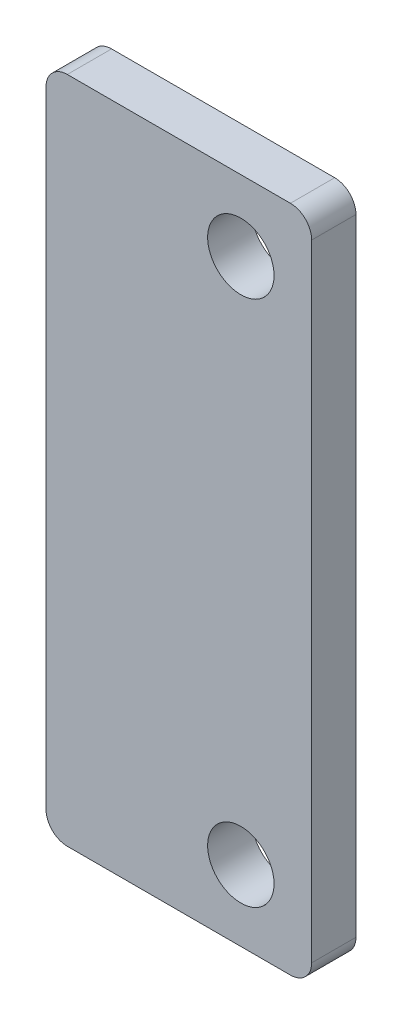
from build123d import *

# Parameters (mm, degrees)
BOSS_EXTRUDE1_DEPTH = 3.175
HOLE1_D             = 4.7625


with BuildPart() as part:
    # Sketch1 → Boss-Extrude1 (new body)
    with BuildSketch(Plane.XY):
        with BuildLine():
            Line((-620.4585, 150.495), (-604.4565, 150.495))
            ThreePointArc((-604.4565, 150.495), (-603.378869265, 150.941369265), (-602.9325, 152.019))
            Line((-602.9325, 152.019), (-602.9325, 196.9135))
            ThreePointArc((-602.9325, 196.9135), (-603.378869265, 197.991130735), (-604.4565, 198.4375))
            Line((-604.4565, 198.4375), (-620.4585, 198.4375))
            ThreePointArc((-620.4585, 198.4375), (-621.536130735, 197.991130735), (-621.9825, 196.9135))
            Line((-621.9825, 196.9135), (-621.9825, 152.019))
            ThreePointArc((-621.9825, 152.019), (-621.536130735, 150.941369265), (-620.4585, 150.495))
        make_face()
    extrude(amount=BOSS_EXTRUDE1_DEPTH)

    # Hole1 (through all)
    with Locations(Plane(origin=(-611.666760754, 203.958640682, 3.175), x_dir=(1, 0, 0), z_dir=(0, 0, 1))):
        with Locations((3.654260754, -10.601140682), (3.654260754, -48.383640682)):
            Hole(HOLE1_D / 2)


solid = part.part
